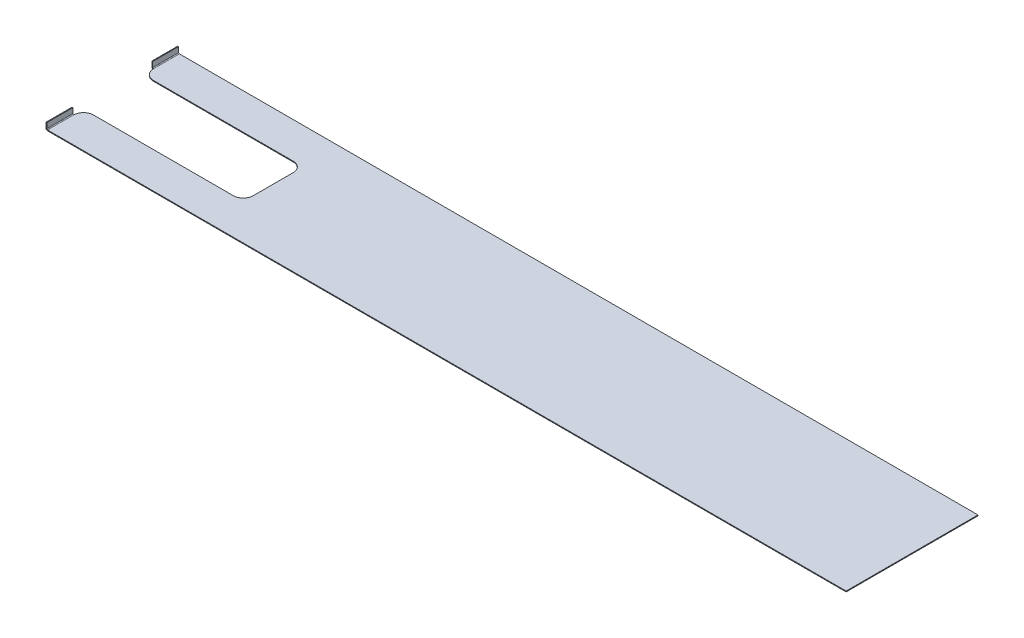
ISO-10303-21;
HEADER;
FILE_DESCRIPTION(('STEP AP214'),'2;1');
FILE_NAME('part.step','',(''),(''),'','','');
FILE_SCHEMA(('AUTOMOTIVE_DESIGN { 1 0 10303 214 1 1 1 1 }'));
ENDSEC;
DATA;
#1=APPLICATION_CONTEXT('core data for automotive mechanical design processes');
#2=APPLICATION_PROTOCOL_DEFINITION('international standard','automotive_design',2000,#1);
#3=PRODUCT_CONTEXT('',#1,'mechanical');
#4=PRODUCT('Part','Part','',(#3));
#5=PRODUCT_RELATED_PRODUCT_CATEGORY('part','',(#4));
#6=PRODUCT_DEFINITION_FORMATION('','',#4);
#7=PRODUCT_DEFINITION_CONTEXT('part definition',#1,'design');
#8=PRODUCT_DEFINITION('design','',#6,#7);
#9=PRODUCT_DEFINITION_SHAPE('','',#8);
#10=(LENGTH_UNIT() NAMED_UNIT(*) SI_UNIT(.MILLI.,.METRE.));
#11=(NAMED_UNIT(*) PLANE_ANGLE_UNIT() SI_UNIT($,.RADIAN.));
#12=(NAMED_UNIT(*) SI_UNIT($,.STERADIAN.) SOLID_ANGLE_UNIT());
#13=UNCERTAINTY_MEASURE_WITH_UNIT(LENGTH_MEASURE(1.E-05),#10,'distance_accuracy_value','');
#14=(GEOMETRIC_REPRESENTATION_CONTEXT(3) GLOBAL_UNCERTAINTY_ASSIGNED_CONTEXT((#13)) GLOBAL_UNIT_ASSIGNED_CONTEXT((#10,
#11,#12)) REPRESENTATION_CONTEXT('',''));
#15=CARTESIAN_POINT('',(0.,0.,0.));
#16=DIRECTION('',(0.,0.,1.));
#17=DIRECTION('',(1.,0.,0.));
#18=AXIS2_PLACEMENT_3D('',#15,#16,#17);
#19=CARTESIAN_POINT('',(-1400.,2.,-75.));
#20=DIRECTION('',(0.,0.,-1.));
#21=DIRECTION('',(-1.,0.,0.));
#22=AXIS2_PLACEMENT_3D('',#19,#20,#21);
#23=PLANE('',#22);
#24=DIRECTION('',(0.,1.,0.));
#25=VECTOR('',#24,1.);
#26=CARTESIAN_POINT('',(-975.,2.,-75.));
#27=LINE('',#26,#25);
#28=CARTESIAN_POINT('',(-975.,0.,-75.));
#29=VERTEX_POINT('',#28);
#30=CARTESIAN_POINT('',(-975.,2.,-75.));
#31=VERTEX_POINT('',#30);
#32=EDGE_CURVE('E13',#29,#31,#27,.T.);
#33=ORIENTED_EDGE('',*,*,#32,.F.);
#34=DIRECTION('',(1.,0.,0.));
#35=VECTOR('',#34,1.);
#36=CARTESIAN_POINT('',(1000.,0.,-75.));
#37=LINE('',#36,#35);
#38=CARTESIAN_POINT('',(-625.,0.,-75.));
#39=VERTEX_POINT('',#38);
#40=EDGE_CURVE('E241',#39,#29,#37,.F.);
#41=ORIENTED_EDGE('',*,*,#40,.F.);
#42=DIRECTION('',(0.,1.,0.));
#43=VECTOR('',#42,1.);
#44=CARTESIAN_POINT('',(-625.,2.,-75.));
#45=LINE('',#44,#43);
#46=CARTESIAN_POINT('',(-625.,2.,-75.));
#47=VERTEX_POINT('',#46);
#48=EDGE_CURVE('E88',#39,#47,#45,.T.);
#49=ORIENTED_EDGE('',*,*,#48,.T.);
#50=DIRECTION('',(-1.,0.,0.));
#51=VECTOR('',#50,1.);
#52=CARTESIAN_POINT('',(-1400.,2.,-75.));
#53=LINE('',#52,#51);
#54=EDGE_CURVE('E258',#47,#31,#53,.T.);
#55=ORIENTED_EDGE('',*,*,#54,.T.);
#56=EDGE_LOOP('',(#33,#41,#49,#55));
#57=FACE_BOUND('',#56,.T.);
#58=ADVANCED_FACE('F78',(#57),#23,.F.);
#59=CARTESIAN_POINT('',(-625.,2.,-50.));
#60=DIRECTION('',(0.,1.,0.));
#61=DIRECTION('',(0.,0.,1.));
#62=AXIS2_PLACEMENT_3D('',#59,#60,#61);
#63=CYLINDRICAL_SURFACE('',#62,25.);
#64=ORIENTED_EDGE('',*,*,#48,.F.);
#65=CARTESIAN_POINT('',(-625.,0.,-50.));
#66=DIRECTION('',(0.,1.,0.));
#67=DIRECTION('',(0.,0.,1.));
#68=AXIS2_PLACEMENT_3D('',#65,#66,#67);
#69=CIRCLE('',#68,25.);
#70=CARTESIAN_POINT('',(-600.,0.,-50.));
#71=VERTEX_POINT('',#70);
#72=EDGE_CURVE('E239',#39,#71,#69,.F.);
#73=ORIENTED_EDGE('',*,*,#72,.T.);
#74=DIRECTION('',(0.,1.,0.));
#75=VECTOR('',#74,1.);
#76=CARTESIAN_POINT('',(-600.,2.,-50.));
#77=LINE('',#76,#75);
#78=CARTESIAN_POINT('',(-600.,2.,-50.));
#79=VERTEX_POINT('',#78);
#80=EDGE_CURVE('E255',#71,#79,#77,.T.);
#81=ORIENTED_EDGE('',*,*,#80,.T.);
#82=CARTESIAN_POINT('',(-625.,2.,-50.));
#83=DIRECTION('',(0.,1.,0.));
#84=DIRECTION('',(0.,0.,1.));
#85=AXIS2_PLACEMENT_3D('',#82,#83,#84);
#86=CIRCLE('',#85,25.);
#87=EDGE_CURVE('E262',#47,#79,#86,.F.);
#88=ORIENTED_EDGE('',*,*,#87,.F.);
#89=EDGE_LOOP('',(#64,#73,#81,#88));
#90=FACE_BOUND('',#89,.T.);
#91=ADVANCED_FACE('F267',(#90),#63,.F.);
#92=CARTESIAN_POINT('',(-600.,2.,-75.));
#93=DIRECTION('',(1.,0.,0.));
#94=DIRECTION('',(0.,0.,-1.));
#95=AXIS2_PLACEMENT_3D('',#92,#93,#94);
#96=PLANE('',#95);
#97=ORIENTED_EDGE('',*,*,#80,.F.);
#98=DIRECTION('',(0.,0.,1.));
#99=VECTOR('',#98,1.);
#100=CARTESIAN_POINT('',(-600.,0.,165.1));
#101=LINE('',#100,#99);
#102=CARTESIAN_POINT('',(-600.,0.,50.));
#103=VERTEX_POINT('',#102);
#104=EDGE_CURVE('E236',#103,#71,#101,.F.);
#105=ORIENTED_EDGE('',*,*,#104,.F.);
#106=DIRECTION('',(0.,1.,0.));
#107=VECTOR('',#106,1.);
#108=CARTESIAN_POINT('',(-600.,2.,50.));
#109=LINE('',#108,#107);
#110=CARTESIAN_POINT('',(-600.,2.,50.));
#111=VERTEX_POINT('',#110);
#112=EDGE_CURVE('E253',#103,#111,#109,.T.);
#113=ORIENTED_EDGE('',*,*,#112,.T.);
#114=DIRECTION('',(0.,0.,-1.));
#115=VECTOR('',#114,1.);
#116=CARTESIAN_POINT('',(-600.,2.,-75.));
#117=LINE('',#116,#115);
#118=EDGE_CURVE('E268',#111,#79,#117,.T.);
#119=ORIENTED_EDGE('',*,*,#118,.T.);
#120=EDGE_LOOP('',(#97,#105,#113,#119));
#121=FACE_BOUND('',#120,.T.);
#122=ADVANCED_FACE('F462',(#121),#96,.F.);
#123=CARTESIAN_POINT('',(-625.,2.,50.));
#124=DIRECTION('',(0.,1.,0.));
#125=DIRECTION('',(0.,0.,1.));
#126=AXIS2_PLACEMENT_3D('',#123,#124,#125);
#127=CYLINDRICAL_SURFACE('',#126,25.);
#128=ORIENTED_EDGE('',*,*,#112,.F.);
#129=CARTESIAN_POINT('',(-625.,0.,50.));
#130=DIRECTION('',(0.,1.,0.));
#131=DIRECTION('',(0.,0.,1.));
#132=AXIS2_PLACEMENT_3D('',#129,#130,#131);
#133=CIRCLE('',#132,25.);
#134=CARTESIAN_POINT('',(-625.,0.,75.));
#135=VERTEX_POINT('',#134);
#136=EDGE_CURVE('E233',#103,#135,#133,.F.);
#137=ORIENTED_EDGE('',*,*,#136,.T.);
#138=DIRECTION('',(0.,1.,0.));
#139=VECTOR('',#138,1.);
#140=CARTESIAN_POINT('',(-625.,2.,75.));
#141=LINE('',#140,#139);
#142=CARTESIAN_POINT('',(-625.,2.,75.));
#143=VERTEX_POINT('',#142);
#144=EDGE_CURVE('E251',#135,#143,#141,.T.);
#145=ORIENTED_EDGE('',*,*,#144,.T.);
#146=CARTESIAN_POINT('',(-625.,2.,50.));
#147=DIRECTION('',(0.,1.,0.));
#148=DIRECTION('',(0.,0.,1.));
#149=AXIS2_PLACEMENT_3D('',#146,#147,#148);
#150=CIRCLE('',#149,25.);
#151=EDGE_CURVE('E270',#111,#143,#150,.F.);
#152=ORIENTED_EDGE('',*,*,#151,.F.);
#153=EDGE_LOOP('',(#128,#137,#145,#152));
#154=FACE_BOUND('',#153,.T.);
#155=ADVANCED_FACE('F458',(#154),#127,.F.);
#156=CARTESIAN_POINT('',(-1400.,2.,75.));
#157=DIRECTION('',(0.,0.,1.));
#158=DIRECTION('',(1.,0.,0.));
#159=AXIS2_PLACEMENT_3D('',#156,#157,#158);
#160=PLANE('',#159);
#161=ORIENTED_EDGE('',*,*,#144,.F.);
#162=DIRECTION('',(1.,0.,0.));
#163=VECTOR('',#162,1.);
#164=CARTESIAN_POINT('',(1000.,0.,75.));
#165=LINE('',#164,#163);
#166=CARTESIAN_POINT('',(-975.,0.,75.));
#167=VERTEX_POINT('',#166);
#168=EDGE_CURVE('E230',#167,#135,#165,.T.);
#169=ORIENTED_EDGE('',*,*,#168,.F.);
#170=DIRECTION('',(0.,1.,0.));
#171=VECTOR('',#170,1.);
#172=CARTESIAN_POINT('',(-975.,2.,75.));
#173=LINE('',#172,#171);
#174=CARTESIAN_POINT('',(-975.,2.,75.));
#175=VERTEX_POINT('',#174);
#176=EDGE_CURVE('E249',#167,#175,#173,.T.);
#177=ORIENTED_EDGE('',*,*,#176,.T.);
#178=DIRECTION('',(1.,0.,0.));
#179=VECTOR('',#178,1.);
#180=CARTESIAN_POINT('',(-1400.,2.,75.));
#181=LINE('',#180,#179);
#182=EDGE_CURVE('E276',#175,#143,#181,.T.);
#183=ORIENTED_EDGE('',*,*,#182,.T.);
#184=EDGE_LOOP('',(#161,#169,#177,#183));
#185=FACE_BOUND('',#184,.T.);
#186=ADVANCED_FACE('F455',(#185),#160,.F.);
#187=CARTESIAN_POINT('',(-975.,2.,100.));
#188=DIRECTION('',(0.,1.,0.));
#189=DIRECTION('',(0.,0.,1.));
#190=AXIS2_PLACEMENT_3D('',#187,#188,#189);
#191=CYLINDRICAL_SURFACE('',#190,25.);
#192=ORIENTED_EDGE('',*,*,#176,.F.);
#193=CARTESIAN_POINT('',(-975.,0.,100.));
#194=DIRECTION('',(0.,1.,0.));
#195=DIRECTION('',(0.,0.,1.));
#196=AXIS2_PLACEMENT_3D('',#193,#194,#195);
#197=CIRCLE('',#196,25.);
#198=CARTESIAN_POINT('',(-1000.,0.,100.));
#199=VERTEX_POINT('',#198);
#200=EDGE_CURVE('E227',#167,#199,#197,.T.);
#201=ORIENTED_EDGE('',*,*,#200,.T.);
#202=DIRECTION('',(0.,1.,0.));
#203=VECTOR('',#202,1.);
#204=CARTESIAN_POINT('',(-1000.,2.,100.));
#205=LINE('',#204,#203);
#206=CARTESIAN_POINT('',(-1000.,2.,100.));
#207=VERTEX_POINT('',#206);
#208=EDGE_CURVE('E247',#199,#207,#205,.T.);
#209=ORIENTED_EDGE('',*,*,#208,.T.);
#210=CARTESIAN_POINT('',(-975.,2.,100.));
#211=DIRECTION('',(0.,1.,0.));
#212=DIRECTION('',(0.,0.,1.));
#213=AXIS2_PLACEMENT_3D('',#210,#211,#212);
#214=CIRCLE('',#213,25.);
#215=EDGE_CURVE('E278',#175,#207,#214,.T.);
#216=ORIENTED_EDGE('',*,*,#215,.F.);
#217=EDGE_LOOP('',(#192,#201,#209,#216));
#218=FACE_BOUND('',#217,.T.);
#219=ADVANCED_FACE('F453',(#218),#191,.T.);
#220=CARTESIAN_POINT('',(-1000.,2.,165.1));
#221=DIRECTION('',(0.,0.,1.));
#222=DIRECTION('',(1.,0.,0.));
#223=AXIS2_PLACEMENT_3D('',#220,#221,#222);
#224=PLANE('',#223);
#225=DIRECTION('',(0.,1.,0.));
#226=VECTOR('',#225,1.);
#227=CARTESIAN_POINT('',(-1000.,2.,165.1));
#228=LINE('',#227,#226);
#229=CARTESIAN_POINT('',(-1000.,0.,165.1));
#230=VERTEX_POINT('',#229);
#231=CARTESIAN_POINT('',(-1000.,2.,165.1));
#232=VERTEX_POINT('',#231);
#233=EDGE_CURVE('E197',#230,#232,#228,.T.);
#234=ORIENTED_EDGE('',*,*,#233,.F.);
#235=DIRECTION('',(1.,0.,0.));
#236=VECTOR('',#235,1.);
#237=CARTESIAN_POINT('',(1000.,0.,165.1));
#238=LINE('',#237,#236);
#239=CARTESIAN_POINT('',(1000.,0.,165.1));
#240=VERTEX_POINT('',#239);
#241=EDGE_CURVE('E192',#230,#240,#238,.T.);
#242=ORIENTED_EDGE('',*,*,#241,.T.);
#243=DIRECTION('',(0.,1.,0.));
#244=VECTOR('',#243,1.);
#245=CARTESIAN_POINT('',(1000.,2.,165.1));
#246=LINE('',#245,#244);
#247=CARTESIAN_POINT('',(1000.,2.,165.1));
#248=VERTEX_POINT('',#247);
#249=EDGE_CURVE('E185',#240,#248,#246,.T.);
#250=ORIENTED_EDGE('',*,*,#249,.T.);
#251=DIRECTION('',(1.,0.,0.));
#252=VECTOR('',#251,1.);
#253=CARTESIAN_POINT('',(-1000.,2.,165.1));
#254=LINE('',#253,#252);
#255=EDGE_CURVE('E189',#232,#248,#254,.T.);
#256=ORIENTED_EDGE('',*,*,#255,.F.);
#257=EDGE_LOOP('',(#234,#242,#250,#256));
#258=FACE_BOUND('',#257,.T.);
#259=ADVANCED_FACE('F188',(#258),#224,.T.);
#260=CARTESIAN_POINT('',(1000.,2.,-165.1));
#261=DIRECTION('',(1.,0.,0.));
#262=DIRECTION('',(0.,0.,-1.));
#263=AXIS2_PLACEMENT_3D('',#260,#261,#262);
#264=PLANE('',#263);
#265=ORIENTED_EDGE('',*,*,#249,.F.);
#266=DIRECTION('',(0.,0.,1.));
#267=VECTOR('',#266,1.);
#268=CARTESIAN_POINT('',(1000.,0.,165.1));
#269=LINE('',#268,#267);
#270=CARTESIAN_POINT('',(1000.,0.,-165.1));
#271=VERTEX_POINT('',#270);
#272=EDGE_CURVE('E221',#240,#271,#269,.F.);
#273=ORIENTED_EDGE('',*,*,#272,.T.);
#274=DIRECTION('',(0.,1.,0.));
#275=VECTOR('',#274,1.);
#276=CARTESIAN_POINT('',(1000.,2.,-165.1));
#277=LINE('',#276,#275);
#278=CARTESIAN_POINT('',(1000.,2.,-165.1));
#279=VERTEX_POINT('',#278);
#280=EDGE_CURVE('E198',#271,#279,#277,.T.);
#281=ORIENTED_EDGE('',*,*,#280,.T.);
#282=DIRECTION('',(0.,0.,-1.));
#283=VECTOR('',#282,1.);
#284=CARTESIAN_POINT('',(1000.,2.,-165.1));
#285=LINE('',#284,#283);
#286=EDGE_CURVE('E203',#248,#279,#285,.T.);
#287=ORIENTED_EDGE('',*,*,#286,.F.);
#288=EDGE_LOOP('',(#265,#273,#281,#287));
#289=FACE_BOUND('',#288,.T.);
#290=ADVANCED_FACE('F208',(#289),#264,.T.);
#291=CARTESIAN_POINT('',(-1000.,2.,-165.1));
#292=DIRECTION('',(0.,0.,-1.));
#293=DIRECTION('',(-1.,0.,0.));
#294=AXIS2_PLACEMENT_3D('',#291,#292,#293);
#295=PLANE('',#294);
#296=ORIENTED_EDGE('',*,*,#280,.F.);
#297=DIRECTION('',(1.,0.,0.));
#298=VECTOR('',#297,1.);
#299=CARTESIAN_POINT('',(1000.,0.,-165.1));
#300=LINE('',#299,#298);
#301=CARTESIAN_POINT('',(-1000.,0.,-165.1));
#302=VERTEX_POINT('',#301);
#303=EDGE_CURVE('E218',#271,#302,#300,.F.);
#304=ORIENTED_EDGE('',*,*,#303,.T.);
#305=DIRECTION('',(0.,1.,0.));
#306=VECTOR('',#305,1.);
#307=CARTESIAN_POINT('',(-1000.,2.,-165.1));
#308=LINE('',#307,#306);
#309=CARTESIAN_POINT('',(-1000.,2.,-165.1));
#310=VERTEX_POINT('',#309);
#311=EDGE_CURVE('E96',#302,#310,#308,.T.);
#312=ORIENTED_EDGE('',*,*,#311,.T.);
#313=DIRECTION('',(-1.,0.,0.));
#314=VECTOR('',#313,1.);
#315=CARTESIAN_POINT('',(-1000.,2.,-165.1));
#316=LINE('',#315,#314);
#317=EDGE_CURVE('E209',#279,#310,#316,.T.);
#318=ORIENTED_EDGE('',*,*,#317,.F.);
#319=EDGE_LOOP('',(#296,#304,#312,#318));
#320=FACE_BOUND('',#319,.T.);
#321=ADVANCED_FACE('F511',(#320),#295,.T.);
#322=CARTESIAN_POINT('',(-975.,2.,-100.));
#323=DIRECTION('',(0.,1.,0.));
#324=DIRECTION('',(0.,0.,1.));
#325=AXIS2_PLACEMENT_3D('',#322,#323,#324);
#326=CYLINDRICAL_SURFACE('',#325,25.);
#327=CARTESIAN_POINT('',(-975.,0.,-100.));
#328=DIRECTION('',(0.,1.,0.));
#329=DIRECTION('',(0.,0.,1.));
#330=AXIS2_PLACEMENT_3D('',#327,#328,#329);
#331=CIRCLE('',#330,25.);
#332=CARTESIAN_POINT('',(-1000.,0.,-100.));
#333=VERTEX_POINT('',#332);
#334=EDGE_CURVE('E145',#333,#29,#331,.T.);
#335=ORIENTED_EDGE('',*,*,#334,.T.);
#336=ORIENTED_EDGE('',*,*,#32,.T.);
#337=CARTESIAN_POINT('',(-975.,2.,-100.));
#338=DIRECTION('',(0.,1.,0.));
#339=DIRECTION('',(0.,0.,1.));
#340=AXIS2_PLACEMENT_3D('',#337,#338,#339);
#341=CIRCLE('',#340,25.);
#342=CARTESIAN_POINT('',(-1000.,2.,-100.));
#343=VERTEX_POINT('',#342);
#344=EDGE_CURVE('E265',#343,#31,#341,.T.);
#345=ORIENTED_EDGE('',*,*,#344,.F.);
#346=DIRECTION('',(0.,1.,0.));
#347=VECTOR('',#346,1.);
#348=CARTESIAN_POINT('',(-1000.,2.,-100.));
#349=LINE('',#348,#347);
#350=EDGE_CURVE('E82',#333,#343,#349,.T.);
#351=ORIENTED_EDGE('',*,*,#350,.F.);
#352=EDGE_LOOP('',(#335,#336,#345,#351));
#353=FACE_BOUND('',#352,.T.);
#354=ADVANCED_FACE('F80',(#353),#326,.T.);
#355=CARTESIAN_POINT('',(1000.,2.,165.1));
#356=DIRECTION('',(0.,1.,0.));
#357=DIRECTION('',(0.,0.,1.));
#358=AXIS2_PLACEMENT_3D('',#355,#356,#357);
#359=PLANE('',#358);
#360=DIRECTION('',(0.,0.,1.));
#361=VECTOR('',#360,1.);
#362=CARTESIAN_POINT('',(-1000.,2.,-165.1));
#363=LINE('',#362,#361);
#364=EDGE_CURVE('E220',#310,#343,#363,.T.);
#365=ORIENTED_EDGE('',*,*,#364,.T.);
#366=ORIENTED_EDGE('',*,*,#344,.T.);
#367=ORIENTED_EDGE('',*,*,#54,.F.);
#368=ORIENTED_EDGE('',*,*,#87,.T.);
#369=ORIENTED_EDGE('',*,*,#118,.F.);
#370=ORIENTED_EDGE('',*,*,#151,.T.);
#371=ORIENTED_EDGE('',*,*,#182,.F.);
#372=ORIENTED_EDGE('',*,*,#215,.T.);
#373=EDGE_CURVE('E206',#207,#232,#363,.T.);
#374=ORIENTED_EDGE('',*,*,#373,.T.);
#375=ORIENTED_EDGE('',*,*,#255,.T.);
#376=ORIENTED_EDGE('',*,*,#286,.T.);
#377=ORIENTED_EDGE('',*,*,#317,.T.);
#378=EDGE_LOOP('',(#365,#366,#367,#368,#369,#370,#371,#372,#374,#375,#376,#377));
#379=FACE_BOUND('',#378,.T.);
#380=ADVANCED_FACE('F202',(#379),#359,.T.);
#381=CARTESIAN_POINT('',(1000.,0.,165.1));
#382=DIRECTION('',(0.,1.,0.));
#383=DIRECTION('',(0.,0.,1.));
#384=AXIS2_PLACEMENT_3D('',#381,#382,#383);
#385=PLANE('',#384);
#386=DIRECTION('',(0.,0.,1.));
#387=VECTOR('',#386,1.);
#388=CARTESIAN_POINT('',(-1000.,0.,165.1));
#389=LINE('',#388,#387);
#390=EDGE_CURVE('E214',#302,#333,#389,.T.);
#391=ORIENTED_EDGE('',*,*,#390,.F.);
#392=ORIENTED_EDGE('',*,*,#303,.F.);
#393=ORIENTED_EDGE('',*,*,#272,.F.);
#394=ORIENTED_EDGE('',*,*,#241,.F.);
#395=DIRECTION('',(0.,0.,1.));
#396=VECTOR('',#395,1.);
#397=CARTESIAN_POINT('',(-1000.,0.,165.1));
#398=LINE('',#397,#396);
#399=EDGE_CURVE('E224',#199,#230,#398,.T.);
#400=ORIENTED_EDGE('',*,*,#399,.F.);
#401=ORIENTED_EDGE('',*,*,#200,.F.);
#402=ORIENTED_EDGE('',*,*,#168,.T.);
#403=ORIENTED_EDGE('',*,*,#136,.F.);
#404=ORIENTED_EDGE('',*,*,#104,.T.);
#405=ORIENTED_EDGE('',*,*,#72,.F.);
#406=ORIENTED_EDGE('',*,*,#40,.T.);
#407=ORIENTED_EDGE('',*,*,#334,.F.);
#408=EDGE_LOOP('',(#391,#392,#393,#394,#400,#401,#402,#403,#404,#405,#406,#407));
#409=FACE_BOUND('',#408,.T.);
#410=ADVANCED_FACE('F451',(#409),#385,.F.);
#411=CARTESIAN_POINT('',(-1000.,4.,-165.1));
#412=DIRECTION('',(0.,0.,-1.));
#413=DIRECTION('',(-1.,0.,0.));
#414=AXIS2_PLACEMENT_3D('',#411,#412,#413);
#415=PLANE('',#414);
#416=DIRECTION('',(1.,0.,0.));
#417=VECTOR('',#416,1.);
#418=CARTESIAN_POINT('',(-1004.,4.,-165.1));
#419=LINE('',#418,#417);
#420=CARTESIAN_POINT('',(-1002.,4.,-165.1));
#421=VERTEX_POINT('',#420);
#422=CARTESIAN_POINT('',(-1004.,4.,-165.1));
#423=VERTEX_POINT('',#422);
#424=EDGE_CURVE('E312',#421,#423,#419,.F.);
#425=ORIENTED_EDGE('',*,*,#424,.F.);
#426=CARTESIAN_POINT('',(-1000.,4.,-165.1));
#427=DIRECTION('',(0.,0.,1.));
#428=DIRECTION('',(1.,0.,0.));
#429=AXIS2_PLACEMENT_3D('',#426,#427,#428);
#430=CIRCLE('',#429,2.);
#431=EDGE_CURVE('E302',#310,#421,#430,.F.);
#432=ORIENTED_EDGE('',*,*,#431,.F.);
#433=ORIENTED_EDGE('',*,*,#311,.F.);
#434=CARTESIAN_POINT('',(-1000.,4.,-165.1));
#435=DIRECTION('',(0.,0.,1.));
#436=DIRECTION('',(1.,0.,0.));
#437=AXIS2_PLACEMENT_3D('',#434,#435,#436);
#438=CIRCLE('',#437,4.);
#439=EDGE_CURVE('E217',#302,#423,#438,.F.);
#440=ORIENTED_EDGE('',*,*,#439,.T.);
#441=EDGE_LOOP('',(#425,#432,#433,#440));
#442=FACE_BOUND('',#441,.T.);
#443=ADVANCED_FACE('F563',(#442),#415,.T.);
#444=CARTESIAN_POINT('',(-1000.,4.,-100.));
#445=DIRECTION('',(0.,0.,-1.));
#446=DIRECTION('',(-1.,0.,0.));
#447=AXIS2_PLACEMENT_3D('',#444,#445,#446);
#448=PLANE('',#447);
#449=CARTESIAN_POINT('',(-1000.,4.,-100.));
#450=DIRECTION('',(0.,0.,1.));
#451=DIRECTION('',(1.,0.,0.));
#452=AXIS2_PLACEMENT_3D('',#449,#450,#451);
#453=CIRCLE('',#452,2.);
#454=CARTESIAN_POINT('',(-1002.,4.,-100.));
#455=VERTEX_POINT('',#454);
#456=EDGE_CURVE('E295',#455,#343,#453,.T.);
#457=ORIENTED_EDGE('',*,*,#456,.F.);
#458=DIRECTION('',(1.,0.,0.));
#459=VECTOR('',#458,1.);
#460=CARTESIAN_POINT('',(-1002.,4.,-100.));
#461=LINE('',#460,#459);
#462=CARTESIAN_POINT('',(-1004.,4.,-100.));
#463=VERTEX_POINT('',#462);
#464=EDGE_CURVE('E317',#455,#463,#461,.F.);
#465=ORIENTED_EDGE('',*,*,#464,.T.);
#466=CARTESIAN_POINT('',(-1000.,4.,-100.));
#467=DIRECTION('',(0.,0.,1.));
#468=DIRECTION('',(1.,0.,0.));
#469=AXIS2_PLACEMENT_3D('',#466,#467,#468);
#470=CIRCLE('',#469,4.);
#471=EDGE_CURVE('E298',#463,#333,#470,.T.);
#472=ORIENTED_EDGE('',*,*,#471,.T.);
#473=ORIENTED_EDGE('',*,*,#350,.T.);
#474=EDGE_LOOP('',(#457,#465,#472,#473));
#475=FACE_BOUND('',#474,.T.);
#476=ADVANCED_FACE('F293',(#475),#448,.F.);
#477=CARTESIAN_POINT('',(-1000.,4.,-100.));
#478=DIRECTION('',(0.,0.,1.));
#479=DIRECTION('',(-1.,0.,0.));
#480=AXIS2_PLACEMENT_3D('',#477,#478,#479);
#481=CYLINDRICAL_SURFACE('',#480,4.);
#482=ORIENTED_EDGE('',*,*,#390,.T.);
#483=ORIENTED_EDGE('',*,*,#471,.F.);
#484=DIRECTION('',(0.,0.,1.));
#485=VECTOR('',#484,1.);
#486=CARTESIAN_POINT('',(-1004.,4.,-165.1));
#487=LINE('',#486,#485);
#488=EDGE_CURVE('E319',#463,#423,#487,.F.);
#489=ORIENTED_EDGE('',*,*,#488,.T.);
#490=ORIENTED_EDGE('',*,*,#439,.F.);
#491=EDGE_LOOP('',(#482,#483,#489,#490));
#492=FACE_BOUND('',#491,.T.);
#493=ADVANCED_FACE('F575',(#492),#481,.T.);
#494=CARTESIAN_POINT('',(-1000.,4.,-100.));
#495=DIRECTION('',(0.,0.,1.));
#496=DIRECTION('',(-1.,0.,0.));
#497=AXIS2_PLACEMENT_3D('',#494,#495,#496);
#498=CYLINDRICAL_SURFACE('',#497,2.);
#499=ORIENTED_EDGE('',*,*,#364,.F.);
#500=ORIENTED_EDGE('',*,*,#431,.T.);
#501=DIRECTION('',(0.,0.,1.));
#502=VECTOR('',#501,1.);
#503=CARTESIAN_POINT('',(-1002.,4.,-165.1));
#504=LINE('',#503,#502);
#505=EDGE_CURVE('E301',#421,#455,#504,.T.);
#506=ORIENTED_EDGE('',*,*,#505,.T.);
#507=ORIENTED_EDGE('',*,*,#456,.T.);
#508=EDGE_LOOP('',(#499,#500,#506,#507));
#509=FACE_BOUND('',#508,.T.);
#510=ADVANCED_FACE('F299',(#509),#498,.F.);
#511=CARTESIAN_POINT('',(-1004.,2.,-165.1));
#512=DIRECTION('',(0.,0.,1.));
#513=DIRECTION('',(1.,0.,0.));
#514=AXIS2_PLACEMENT_3D('',#511,#512,#513);
#515=PLANE('',#514);
#516=ORIENTED_EDGE('',*,*,#424,.T.);
#517=DIRECTION('',(0.,-1.,0.));
#518=VECTOR('',#517,1.);
#519=CARTESIAN_POINT('',(-1004.,17.,-165.1));
#520=LINE('',#519,#518);
#521=CARTESIAN_POINT('',(-1004.,17.,-165.1));
#522=VERTEX_POINT('',#521);
#523=EDGE_CURVE('E330',#522,#423,#520,.T.);
#524=ORIENTED_EDGE('',*,*,#523,.F.);
#525=DIRECTION('',(1.,0.,0.));
#526=VECTOR('',#525,1.);
#527=CARTESIAN_POINT('',(-1004.,17.,-165.1));
#528=LINE('',#527,#526);
#529=CARTESIAN_POINT('',(-1002.,17.,-165.1));
#530=VERTEX_POINT('',#529);
#531=EDGE_CURVE('E306',#522,#530,#528,.T.);
#532=ORIENTED_EDGE('',*,*,#531,.T.);
#533=DIRECTION('',(0.,1.,0.));
#534=VECTOR('',#533,1.);
#535=CARTESIAN_POINT('',(-1002.,2.,-165.1));
#536=LINE('',#535,#534);
#537=EDGE_CURVE('E321',#530,#421,#536,.F.);
#538=ORIENTED_EDGE('',*,*,#537,.T.);
#539=EDGE_LOOP('',(#516,#524,#532,#538));
#540=FACE_BOUND('',#539,.T.);
#541=ADVANCED_FACE('F602',(#540),#515,.F.);
#542=CARTESIAN_POINT('',(-1004.,17.,-99.9999999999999));
#543=DIRECTION('',(0.,0.,-1.));
#544=DIRECTION('',(0.,1.,0.));
#545=AXIS2_PLACEMENT_3D('',#542,#543,#544);
#546=PLANE('',#545);
#547=ORIENTED_EDGE('',*,*,#464,.F.);
#548=DIRECTION('',(0.,-1.,0.));
#549=VECTOR('',#548,1.);
#550=CARTESIAN_POINT('',(-1002.,17.,-99.9999999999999));
#551=LINE('',#550,#549);
#552=CARTESIAN_POINT('',(-1002.,17.,-99.9999999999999));
#553=VERTEX_POINT('',#552);
#554=EDGE_CURVE('E324',#455,#553,#551,.F.);
#555=ORIENTED_EDGE('',*,*,#554,.T.);
#556=DIRECTION('',(1.,0.,0.));
#557=VECTOR('',#556,1.);
#558=CARTESIAN_POINT('',(-1004.,17.,-99.9999999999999));
#559=LINE('',#558,#557);
#560=CARTESIAN_POINT('',(-1004.,17.,-99.9999999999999));
#561=VERTEX_POINT('',#560);
#562=EDGE_CURVE('E303',#561,#553,#559,.T.);
#563=ORIENTED_EDGE('',*,*,#562,.F.);
#564=DIRECTION('',(0.,1.,0.));
#565=VECTOR('',#564,1.);
#566=CARTESIAN_POINT('',(-1004.,16.9999999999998,-99.9999999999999));
#567=LINE('',#566,#565);
#568=EDGE_CURVE('E333',#463,#561,#567,.T.);
#569=ORIENTED_EDGE('',*,*,#568,.F.);
#570=EDGE_LOOP('',(#547,#555,#563,#569));
#571=FACE_BOUND('',#570,.T.);
#572=ADVANCED_FACE('F612',(#571),#546,.F.);
#573=CARTESIAN_POINT('',(-1004.,17.,-165.1));
#574=DIRECTION('',(1.,0.,0.));
#575=DIRECTION('',(0.,0.,-1.));
#576=AXIS2_PLACEMENT_3D('',#573,#574,#575);
#577=PLANE('',#576);
#578=ORIENTED_EDGE('',*,*,#488,.F.);
#579=ORIENTED_EDGE('',*,*,#568,.T.);
#580=DIRECTION('',(0.,0.,-1.));
#581=VECTOR('',#580,1.);
#582=CARTESIAN_POINT('',(-1004.,17.,-165.1));
#583=LINE('',#582,#581);
#584=EDGE_CURVE('E336',#561,#522,#583,.T.);
#585=ORIENTED_EDGE('',*,*,#584,.T.);
#586=ORIENTED_EDGE('',*,*,#523,.T.);
#587=EDGE_LOOP('',(#578,#579,#585,#586));
#588=FACE_BOUND('',#587,.T.);
#589=ADVANCED_FACE('F623',(#588),#577,.F.);
#590=CARTESIAN_POINT('',(-1002.,17.,-165.1));
#591=DIRECTION('',(1.,0.,0.));
#592=DIRECTION('',(0.,0.,-1.));
#593=AXIS2_PLACEMENT_3D('',#590,#591,#592);
#594=PLANE('',#593);
#595=ORIENTED_EDGE('',*,*,#554,.F.);
#596=ORIENTED_EDGE('',*,*,#505,.F.);
#597=ORIENTED_EDGE('',*,*,#537,.F.);
#598=DIRECTION('',(0.,0.,1.));
#599=VECTOR('',#598,1.);
#600=CARTESIAN_POINT('',(-1002.,17.,-165.1));
#601=LINE('',#600,#599);
#602=EDGE_CURVE('E327',#553,#530,#601,.F.);
#603=ORIENTED_EDGE('',*,*,#602,.F.);
#604=EDGE_LOOP('',(#595,#596,#597,#603));
#605=FACE_BOUND('',#604,.T.);
#606=ADVANCED_FACE('F634',(#605),#594,.T.);
#607=CARTESIAN_POINT('',(-1004.,17.,-165.1));
#608=DIRECTION('',(0.,-1.,0.));
#609=DIRECTION('',(0.,0.,-1.));
#610=AXIS2_PLACEMENT_3D('',#607,#608,#609);
#611=PLANE('',#610);
#612=ORIENTED_EDGE('',*,*,#602,.T.);
#613=ORIENTED_EDGE('',*,*,#531,.F.);
#614=ORIENTED_EDGE('',*,*,#584,.F.);
#615=ORIENTED_EDGE('',*,*,#562,.T.);
#616=EDGE_LOOP('',(#612,#613,#614,#615));
#617=FACE_BOUND('',#616,.T.);
#618=ADVANCED_FACE('F645',(#617),#611,.F.);
#619=CARTESIAN_POINT('',(-1000.,4.,100.));
#620=DIRECTION('',(0.,0.,-1.));
#621=DIRECTION('',(-1.,0.,0.));
#622=AXIS2_PLACEMENT_3D('',#619,#620,#621);
#623=PLANE('',#622);
#624=DIRECTION('',(1.,0.,0.));
#625=VECTOR('',#624,1.);
#626=CARTESIAN_POINT('',(-1004.,4.,100.));
#627=LINE('',#626,#625);
#628=CARTESIAN_POINT('',(-1002.,4.,100.));
#629=VERTEX_POINT('',#628);
#630=CARTESIAN_POINT('',(-1004.,4.,100.));
#631=VERTEX_POINT('',#630);
#632=EDGE_CURVE('E353',#629,#631,#627,.F.);
#633=ORIENTED_EDGE('',*,*,#632,.F.);
#634=CARTESIAN_POINT('',(-1000.,4.,100.));
#635=DIRECTION('',(0.,0.,1.));
#636=DIRECTION('',(1.,0.,0.));
#637=AXIS2_PLACEMENT_3D('',#634,#635,#636);
#638=CIRCLE('',#637,2.);
#639=EDGE_CURVE('E344',#207,#629,#638,.F.);
#640=ORIENTED_EDGE('',*,*,#639,.F.);
#641=ORIENTED_EDGE('',*,*,#208,.F.);
#642=CARTESIAN_POINT('',(-1000.,4.,100.));
#643=DIRECTION('',(0.,0.,1.));
#644=DIRECTION('',(1.,0.,0.));
#645=AXIS2_PLACEMENT_3D('',#642,#643,#644);
#646=CIRCLE('',#645,4.);
#647=EDGE_CURVE('E315',#199,#631,#646,.F.);
#648=ORIENTED_EDGE('',*,*,#647,.T.);
#649=EDGE_LOOP('',(#633,#640,#641,#648));
#650=FACE_BOUND('',#649,.T.);
#651=ADVANCED_FACE('F447',(#650),#623,.T.);
#652=CARTESIAN_POINT('',(-1000.,4.,165.1));
#653=DIRECTION('',(0.,0.,-1.));
#654=DIRECTION('',(-1.,0.,0.));
#655=AXIS2_PLACEMENT_3D('',#652,#653,#654);
#656=PLANE('',#655);
#657=CARTESIAN_POINT('',(-1000.,4.,165.1));
#658=DIRECTION('',(0.,0.,1.));
#659=DIRECTION('',(1.,0.,0.));
#660=AXIS2_PLACEMENT_3D('',#657,#658,#659);
#661=CIRCLE('',#660,2.);
#662=CARTESIAN_POINT('',(-1002.,4.,165.1));
#663=VERTEX_POINT('',#662);
#664=EDGE_CURVE('E341',#663,#232,#661,.T.);
#665=ORIENTED_EDGE('',*,*,#664,.F.);
#666=DIRECTION('',(1.,0.,0.));
#667=VECTOR('',#666,1.);
#668=CARTESIAN_POINT('',(-1002.,4.,165.1));
#669=LINE('',#668,#667);
#670=CARTESIAN_POINT('',(-1004.,4.,165.1));
#671=VERTEX_POINT('',#670);
#672=EDGE_CURVE('E359',#663,#671,#669,.F.);
#673=ORIENTED_EDGE('',*,*,#672,.T.);
#674=CARTESIAN_POINT('',(-1000.,4.,165.1));
#675=DIRECTION('',(0.,0.,1.));
#676=DIRECTION('',(1.,0.,0.));
#677=AXIS2_PLACEMENT_3D('',#674,#675,#676);
#678=CIRCLE('',#677,4.);
#679=EDGE_CURVE('E348',#671,#230,#678,.T.);
#680=ORIENTED_EDGE('',*,*,#679,.T.);
#681=ORIENTED_EDGE('',*,*,#233,.T.);
#682=EDGE_LOOP('',(#665,#673,#680,#681));
#683=FACE_BOUND('',#682,.T.);
#684=ADVANCED_FACE('F443',(#683),#656,.F.);
#685=CARTESIAN_POINT('',(-1000.,4.,165.1));
#686=DIRECTION('',(0.,0.,1.));
#687=DIRECTION('',(-1.,0.,0.));
#688=AXIS2_PLACEMENT_3D('',#685,#686,#687);
#689=CYLINDRICAL_SURFACE('',#688,4.);
#690=ORIENTED_EDGE('',*,*,#399,.T.);
#691=ORIENTED_EDGE('',*,*,#679,.F.);
#692=DIRECTION('',(0.,0.,1.));
#693=VECTOR('',#692,1.);
#694=CARTESIAN_POINT('',(-1004.,4.,100.));
#695=LINE('',#694,#693);
#696=EDGE_CURVE('E362',#671,#631,#695,.F.);
#697=ORIENTED_EDGE('',*,*,#696,.T.);
#698=ORIENTED_EDGE('',*,*,#647,.F.);
#699=EDGE_LOOP('',(#690,#691,#697,#698));
#700=FACE_BOUND('',#699,.T.);
#701=ADVANCED_FACE('F449',(#700),#689,.T.);
#702=CARTESIAN_POINT('',(-1000.,4.,165.1));
#703=DIRECTION('',(0.,0.,1.));
#704=DIRECTION('',(-1.,0.,0.));
#705=AXIS2_PLACEMENT_3D('',#702,#703,#704);
#706=CYLINDRICAL_SURFACE('',#705,2.);
#707=ORIENTED_EDGE('',*,*,#373,.F.);
#708=ORIENTED_EDGE('',*,*,#639,.T.);
#709=DIRECTION('',(0.,0.,1.));
#710=VECTOR('',#709,1.);
#711=CARTESIAN_POINT('',(-1002.,4.,100.));
#712=LINE('',#711,#710);
#713=EDGE_CURVE('E356',#629,#663,#712,.T.);
#714=ORIENTED_EDGE('',*,*,#713,.T.);
#715=ORIENTED_EDGE('',*,*,#664,.T.);
#716=EDGE_LOOP('',(#707,#708,#714,#715));
#717=FACE_BOUND('',#716,.T.);
#718=ADVANCED_FACE('F445',(#717),#706,.F.);
#719=CARTESIAN_POINT('',(-1004.,2.,100.));
#720=DIRECTION('',(0.,0.,1.));
#721=DIRECTION('',(0.,-1.,0.));
#722=AXIS2_PLACEMENT_3D('',#719,#720,#721);
#723=PLANE('',#722);
#724=ORIENTED_EDGE('',*,*,#632,.T.);
#725=DIRECTION('',(0.,-1.,0.));
#726=VECTOR('',#725,1.);
#727=CARTESIAN_POINT('',(-1004.,17.,100.));
#728=LINE('',#727,#726);
#729=CARTESIAN_POINT('',(-1004.,17.,100.));
#730=VERTEX_POINT('',#729);
#731=EDGE_CURVE('E374',#730,#631,#728,.T.);
#732=ORIENTED_EDGE('',*,*,#731,.F.);
#733=DIRECTION('',(1.,0.,0.));
#734=VECTOR('',#733,1.);
#735=CARTESIAN_POINT('',(-1004.,17.,100.));
#736=LINE('',#735,#734);
#737=CARTESIAN_POINT('',(-1002.,17.,100.));
#738=VERTEX_POINT('',#737);
#739=EDGE_CURVE('E383',#730,#738,#736,.T.);
#740=ORIENTED_EDGE('',*,*,#739,.T.);
#741=DIRECTION('',(0.,1.,0.));
#742=VECTOR('',#741,1.);
#743=CARTESIAN_POINT('',(-1002.,2.,100.));
#744=LINE('',#743,#742);
#745=EDGE_CURVE('E365',#738,#629,#744,.F.);
#746=ORIENTED_EDGE('',*,*,#745,.T.);
#747=EDGE_LOOP('',(#724,#732,#740,#746));
#748=FACE_BOUND('',#747,.T.);
#749=ADVANCED_FACE('F409',(#748),#723,.F.);
#750=CARTESIAN_POINT('',(-1004.,17.,165.1));
#751=DIRECTION('',(0.,0.,-1.));
#752=DIRECTION('',(-1.,0.,0.));
#753=AXIS2_PLACEMENT_3D('',#750,#751,#752);
#754=PLANE('',#753);
#755=ORIENTED_EDGE('',*,*,#672,.F.);
#756=DIRECTION('',(0.,-1.,0.));
#757=VECTOR('',#756,1.);
#758=CARTESIAN_POINT('',(-1002.,17.,165.1));
#759=LINE('',#758,#757);
#760=CARTESIAN_POINT('',(-1002.,17.,165.1));
#761=VERTEX_POINT('',#760);
#762=EDGE_CURVE('E368',#663,#761,#759,.F.);
#763=ORIENTED_EDGE('',*,*,#762,.T.);
#764=DIRECTION('',(1.,0.,0.));
#765=VECTOR('',#764,1.);
#766=CARTESIAN_POINT('',(-1004.,17.,165.1));
#767=LINE('',#766,#765);
#768=CARTESIAN_POINT('',(-1004.,17.,165.1));
#769=VERTEX_POINT('',#768);
#770=EDGE_CURVE('E345',#769,#761,#767,.T.);
#771=ORIENTED_EDGE('',*,*,#770,.F.);
#772=DIRECTION('',(0.,1.,0.));
#773=VECTOR('',#772,1.);
#774=CARTESIAN_POINT('',(-1004.,17.,165.1));
#775=LINE('',#774,#773);
#776=EDGE_CURVE('E377',#671,#769,#775,.T.);
#777=ORIENTED_EDGE('',*,*,#776,.F.);
#778=EDGE_LOOP('',(#755,#763,#771,#777));
#779=FACE_BOUND('',#778,.T.);
#780=ADVANCED_FACE('F440',(#779),#754,.F.);
#781=CARTESIAN_POINT('',(-1004.,17.,100.));
#782=DIRECTION('',(1.,0.,0.));
#783=DIRECTION('',(0.,0.,-1.));
#784=AXIS2_PLACEMENT_3D('',#781,#782,#783);
#785=PLANE('',#784);
#786=ORIENTED_EDGE('',*,*,#696,.F.);
#787=ORIENTED_EDGE('',*,*,#776,.T.);
#788=DIRECTION('',(0.,0.,-1.));
#789=VECTOR('',#788,1.);
#790=CARTESIAN_POINT('',(-1004.,17.,100.));
#791=LINE('',#790,#789);
#792=EDGE_CURVE('E380',#769,#730,#791,.T.);
#793=ORIENTED_EDGE('',*,*,#792,.T.);
#794=ORIENTED_EDGE('',*,*,#731,.T.);
#795=EDGE_LOOP('',(#786,#787,#793,#794));
#796=FACE_BOUND('',#795,.T.);
#797=ADVANCED_FACE('F438',(#796),#785,.F.);
#798=CARTESIAN_POINT('',(-1002.,17.,100.));
#799=DIRECTION('',(1.,0.,0.));
#800=DIRECTION('',(0.,0.,-1.));
#801=AXIS2_PLACEMENT_3D('',#798,#799,#800);
#802=PLANE('',#801);
#803=ORIENTED_EDGE('',*,*,#762,.F.);
#804=ORIENTED_EDGE('',*,*,#713,.F.);
#805=ORIENTED_EDGE('',*,*,#745,.F.);
#806=DIRECTION('',(0.,0.,1.));
#807=VECTOR('',#806,1.);
#808=CARTESIAN_POINT('',(-1002.,17.,100.));
#809=LINE('',#808,#807);
#810=EDGE_CURVE('E371',#761,#738,#809,.F.);
#811=ORIENTED_EDGE('',*,*,#810,.F.);
#812=EDGE_LOOP('',(#803,#804,#805,#811));
#813=FACE_BOUND('',#812,.T.);
#814=ADVANCED_FACE('F403',(#813),#802,.T.);
#815=CARTESIAN_POINT('',(-1004.,17.,100.));
#816=DIRECTION('',(0.,-1.,0.));
#817=DIRECTION('',(0.,0.,-1.));
#818=AXIS2_PLACEMENT_3D('',#815,#816,#817);
#819=PLANE('',#818);
#820=ORIENTED_EDGE('',*,*,#810,.T.);
#821=ORIENTED_EDGE('',*,*,#739,.F.);
#822=ORIENTED_EDGE('',*,*,#792,.F.);
#823=ORIENTED_EDGE('',*,*,#770,.T.);
#824=EDGE_LOOP('',(#820,#821,#822,#823));
#825=FACE_BOUND('',#824,.T.);
#826=ADVANCED_FACE('F392',(#825),#819,.F.);
#827=CLOSED_SHELL('',(#58,#91,#122,#155,#186,#219,#259,#290,#321,#354,#380,#410,#443,#476,#493,
#510,#541,#572,#589,#606,#618,#651,#684,#701,#718,#749,#780,#797,#814,#826));
#828=MANIFOLD_SOLID_BREP('B2',#827);
#829=ADVANCED_BREP_SHAPE_REPRESENTATION('',(#18,#828),#14);
#830=SHAPE_DEFINITION_REPRESENTATION(#9,#829);
ENDSEC;
END-ISO-10303-21;
